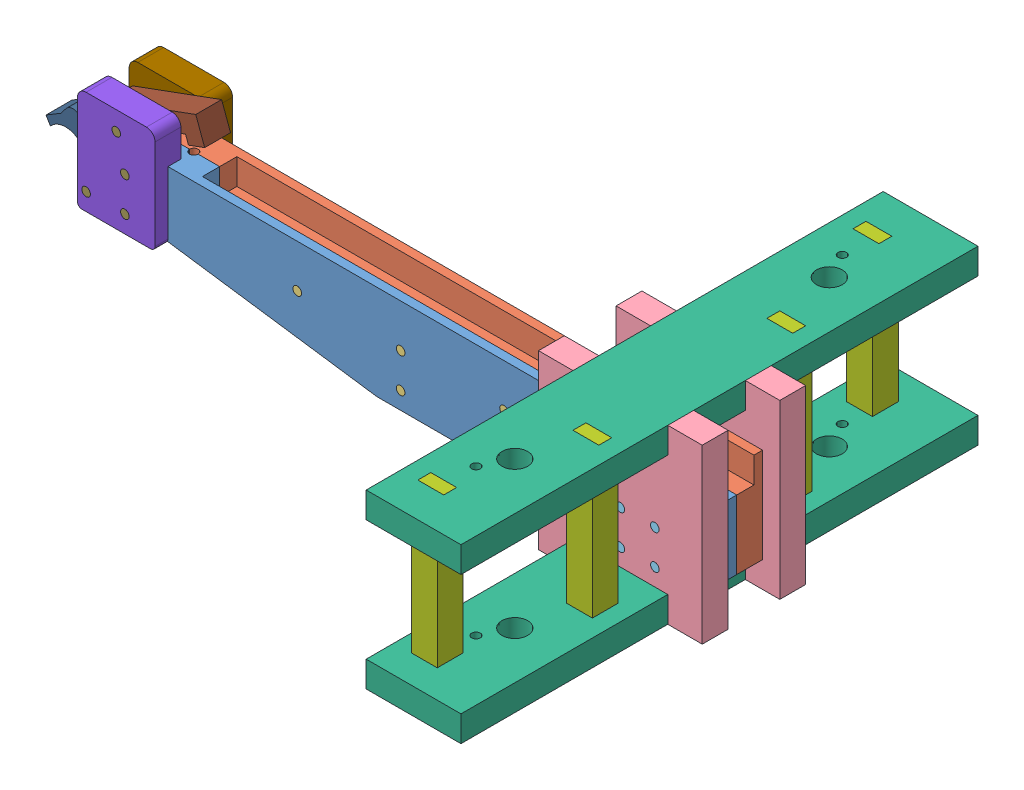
SolidWorks assembly balistav2.SLDASM, configuration Default (file format 4700). Lengths in mm.
Overall size (513.53 127 381).
31 component instances, 12 part files, 51 mates.
Components (placement in the parent):
- bodyv2-1: bodyv2.SLDPRT [Default] at (214.663 -71.4496 -64.7329) size (444.5 69.85 19.05)
- bodyv2left-1: bodyv2left.SLDPRT [Default] at (214.663 -71.4496 -64.7329) size (444.5 69.85 19.05)
- pin-1: pin.SLDPRT [Default] at (-13.937 -58.7496 -102.8329) size (6.35 6.35 38.1)
- pin-2: pin.SLDPRT [Default] at (62.263 -58.7496 -102.8329) size (6.35 6.35 38.1)
- pin-3: pin.SLDPRT [Default] at (-90.137 -33.3496 -102.8329) x (0.999896 -0.014417 0) z (0 0 1) size (6.35 6.35 38.1)
- pin-4: pin.SLDPRT [Default] at (-13.937 -33.3496 -102.8329) x (-0.041349 -0.999145 0) z (0 0 1) size (6.35 6.35 38.1)
- pin-5: pin.SLDPRT [Default] at (62.263 -33.3496 -102.8329) size (6.35 6.35 38.1)
- sidesv2-1: sidesv2.SLDPRT [Default] at (124.1755 -90.4996 -64.7329) size (120.65 127 19.05)
- sidesv2-2: sidesv2.SLDPRT [Default] at (124.1755 -90.4996 -121.8829) size (120.65 127 19.05)
- pin-8: pin.SLDPRT [Default] at (-207.612 -38.2965 -102.8329) size (6.35 6.35 38.1)
- pin-9: pin.SLDPRT [Default] at (-207.612 -12.8965 -102.8329) size (6.35 6.35 38.1)
- pin2-1: pin2.SLDPRT [Default] at (192.438 -58.7496 -121.8829) size (6.35 6.35 76.2)
- pin2-2: pin2.SLDPRT [Default] at (167.038 -58.7496 -121.8829) size (6.35 6.35 76.2)
- pin2-3: pin2.SLDPRT [Default] at (141.638 -58.7496 -121.8829) size (6.35 6.35 76.2)
- pin2-4: pin2.SLDPRT [Default] at (167.038 -33.3496 -121.8829) size (6.35 6.35 76.2)
- pin2-5: pin2.SLDPRT [Default] at (192.438 -33.3496 -121.8829) size (6.35 6.35 76.2)
- pin2-6: pin2.SLDPRT [Default] at (141.638 -33.3496 -121.8829) size (6.35 6.35 76.2)
- balista top v2-1: balista top v2.SLDPRT [Default] at (132.113 -90.4996 -274.2829) x (0 0 1) z (-1 0 0) size (381 19.05 69.85)
- balista top v2-2: balista top v2.SLDPRT [Default] at (132.113 17.4504 -274.2829) x (0 0 1) z (-1 0 0) size (381 19.05 69.85)
- supports-1: supports.SLDPRT [Default] at (144.813 -71.4496 86.0796) x (0 0 -1) z (1 0 0) size (19.05 127 19.05)
- supports-2: supports.SLDPRT [Default] at (170.213 -71.4496 -2.8204) x (0 0 -1) z (1 0 0) size (19.05 127 19.05)
- supports-3: supports.SLDPRT [Default] at (144.813 -71.4496 -234.5954) x (0 0 -1) z (1 0 0) size (19.05 127 19.05)
- supports-4: supports.SLDPRT [Default] at (170.213 -71.4496 -145.6954) x (0 0 -1) z (1 0 0) size (19.05 127 19.05)
- lock plate1-1: lock plate1.SLDPRT [Default] at (-185.387 -50.9965 -55.2079) x (-1 0 0) z (0 0 -1) size (57.15 76.2 19.05)
- lock plate2-1: lock plate2.SLDPRT [Default] at (-185.387 -50.9965 -93.3079) x (-1 0 0) z (0 0 -1) size (57.15 76.2 19.05)
- hammer-1: hammer.SLDPRT [Default] at (-236.187 -38.2965 -93.3079) x (0.619933 0.784655 0) z (0 0 1) size (26.82 53.87 19.05)
- top lock-1: top lock.SLDPRT [Default] at (-213.962 11.1004 -93.3079) x (0.938846 0.344336 0) z (0 0 1) size (69.85 19.05 19.05)
- lock mechanism pin-1: lock mechanism pin.SLDPRT [Default] at (-207.612 -38.2965 -112.3579) size (6.35 6.35 57.15)
- lock mechanism pin-2: lock mechanism pin.SLDPRT [Default] at (-207.612 -12.8965 -112.3579) size (6.35 6.35 57.15)
- lock mechanism pin-3: lock mechanism pin.SLDPRT [Default] at (-236.187 -38.2965 -112.3579) size (6.35 6.35 57.15)
- lock mechanism pin-4: lock mechanism pin.SLDPRT [Default] at (-213.962 11.1004 -112.3579) size (6.35 6.35 57.15)
Mates (geometry in assembly coordinates):
- Coincident1: coincident anti-aligned: plane of bodyv2-1 through (-414.611 -1.5996 -83.7829) normal (0 0 -1); plane of bodyv2left-1 through (-229.837 621.5447 -83.7829) normal (0 0 1)
- Coincident2: coincident: point of bodyv2-1; point of bodyv2left-1
- Coincident3: coincident: point of bodyv2-1; point of bodyv2left-1
- Coincident4: coincident aligned: circle of bodyv2-1; circle of pin-3
- Coincident5: coincident aligned: circle of bodyv2-1; circle of pin-4
- Coincident6: coincident aligned: circle of bodyv2-1; circle of pin-1
- Coincident7: coincident aligned: circle of bodyv2-1; circle of pin-5
- Coincident8: coincident aligned: circle of bodyv2-1; circle of pin-2
- Coincident9: coincident anti-aligned: circle of bodyv2-1; circle of sidesv2-1
- Coincident10: coincident anti-aligned: circle of bodyv2-1; circle of sidesv2-1
- Coincident11: coincident aligned: circle of bodyv2left-1; circle of sidesv2-2
- Coincident12: coincident aligned: circle of bodyv2left-1; circle of sidesv2-2
- Coincident13: coincident aligned: circle of bodyv2-1; circle of pin-9
- Coincident14: coincident aligned: circle of bodyv2-1; circle of pin-8
- Coincident15: coincident aligned: circle of sidesv2-1; circle of pin2-6
- Coincident16: coincident aligned: circle of sidesv2-1; circle of pin2-4
- Coincident17: coincident aligned: circle of sidesv2-1; circle of pin2-5
- Coincident18: coincident aligned: circle of sidesv2-1; circle of pin2-3
- Coincident19: coincident aligned: circle of sidesv2-1; circle of pin2-2
- Coincident20: coincident aligned: circle of sidesv2-1; circle of pin2-1
- Coincident27: coincident anti-aligned: plane of sidesv2-2 through (167.038 17.4504 -102.8329) normal (0 1 0); plane of balista top v2-2 through (167.038 17.4504 -385.2119) normal (0 -1 0)
- Coincident28: coincident anti-aligned: plane of sidesv2-1 through (167.038 17.4504 -45.6829) normal (0 1 0); plane of balista top v2-2 through (167.038 17.4504 -385.2119) normal (0 -1 0)
- Coincident29: coincident anti-aligned: line of sidesv2-2 through (201.963 17.4504 -102.8329) axis (0 0 -1); line of balista top v2-2 through (201.963 17.4504 -274.2829) axis (0 0 1)
- Coincident30: coincident anti-aligned: line of sidesv2-1 through (201.963 17.4504 -45.6829) axis (0 0 -1); line of balista top v2-2 through (201.963 17.4504 -274.2829) axis (0 0 1)
- Coincident31: coincident anti-aligned: plane of sidesv2-1 through (167.038 -71.4496 -45.6829) normal (0 -1 0); plane of balista top v2-1 through (167.038 -71.4496 -385.2119) normal (0 1 0)
- Coincident32: coincident anti-aligned: plane of sidesv2-2 through (167.038 -71.4496 -102.8329) normal (0 -1 0); plane of balista top v2-1 through (167.038 -71.4496 -385.2119) normal (0 1 0)
- Coincident33: coincident anti-aligned: line of sidesv2-1 through (201.963 -71.4496 -45.6829) axis (0 0 -1); line of balista top v2-1 through (201.963 -71.4496 -274.2829) axis (0 0 1)
- Coincident34: coincident: point of balista top v2-2; point of supports-1
- Coincident35: coincident: point of balista top v2-2; point of supports-1
- Coincident36: coincident: point of balista top v2-1; line of supports-1 through (163.863 -71.4496 81.3171) axis (0 -1 0)
- Coincident37: coincident: point of balista top v2-2; point of supports-2
- Coincident38: coincident: point of balista top v2-2; point of supports-2
- Coincident39: coincident: point of balista top v2-1; point of supports-2
- Coincident40: coincident: point of balista top v2-2; point of supports-4
- Coincident41: coincident: point of balista top v2-2; point of supports-4
- Coincident42: coincident: point of balista top v2-1; point of supports-4
- Coincident43: coincident: point of balista top v2-2; point of supports-3
- Coincident44: coincident: point of balista top v2-2; point of supports-3
- Coincident45: coincident: point of balista top v2-1; point of supports-3
- Coincident54: coincident anti-aligned: plane of bodyv2left-1 through (-414.611 -1.5996 -102.8329) normal (0 0 -1); plane of lock plate2-1 through (-229.837 -1.5996 -102.8329) normal (0 0 1)
- Coincident55: coincident aligned: line of bodyv2left-1 through (214.663 -1.5996 -102.8329) axis (-1 0 0); line of lock plate2-1 through (-185.387 -1.5996 -102.8329) axis (-1 0 0)
- Coincident56: coincident anti-aligned: line of bodyv2left-1 through (-229.837 -49.5933 -102.8329) axis (0 1 0); line of lock plate2-1 through (-229.837 -1.5996 -102.8329) axis (0 -1 0)
- Coincident57: coincident anti-aligned: plane of bodyv2-1 through (-414.611 -1.5996 -64.7329) normal (0 0 1); plane of lock plate1-1 through (-213.962 -87.125 -64.7329) normal (0 0 -1)
- Coincident58: coincident anti-aligned: line of bodyv2-1 through (214.663 -1.5996 -64.7329) axis (-1 0 0); line of lock plate1-1 through (-229.837 -1.5996 -64.7329) axis (1 0 0)
- Coincident60: coincident anti-aligned: line of bodyv2-1 through (-229.837 -49.5933 -64.7329) axis (0 1 0); line of lock plate1-1 through (-229.837 -1.5996 -64.7329) axis (0 -1 0)
- Coincident61: coincident anti-aligned: circle of lock plate1-1; circle of hammer-1
- Coincident62: coincident anti-aligned: circle of lock plate1-1; circle of top lock-1
- Coincident63: coincident anti-aligned: circle of lock plate1-1; circle of lock mechanism pin-4
- Coincident64: coincident anti-aligned: circle of lock plate1-1; circle of lock mechanism pin-2
- Coincident65: coincident anti-aligned: circle of lock plate1-1; circle of lock mechanism pin-3
- Coincident66: coincident anti-aligned: circle of lock plate1-1; circle of lock mechanism pin-1
